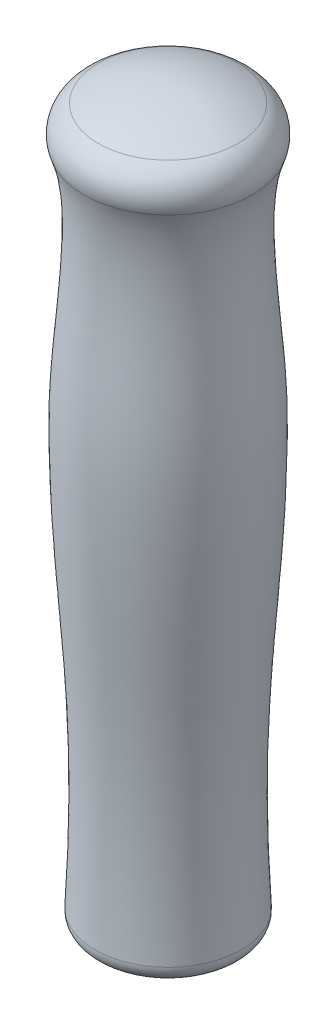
from build123d import *

# Parameters (mm, degrees)
FILLET1_R = 2.54
FILLET2_R = 4.7625


with BuildPart() as part:
    # Sketch1 → Revolve1 (revolve)
    with BuildSketch(Plane.XY):
        with BuildLine():
            Line((7.9375, 0), (11.7475, 0))
            add(Edge.make_bspline(
                [(11.7475, 0), (9.90178857, 30.057250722), (13.130992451, 43.656543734), (13.602666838, 83.018924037), (9.458950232, 103.277798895), (15.147412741, 110.596527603)],
                knots=[0, 0, 0, 0, 0.584486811, 0.665001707, 1, 1, 1, 1], degree=3))
            ThreePointArc((15.147412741, 110.596527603), (8.022445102, 114.526698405), (0, 115.8875))
            Line((0, 115.8875), (0, 113.212488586))
            ThreePointArc((0, 113.212488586), (4.039674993, 112.832323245), (7.9375, 111.705176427))
            Line((7.9375, 111.705176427), (7.9375, 0))
        make_face()
    revolve(axis=Axis((0, 0, 0), (0, 1, 0)))

    # Fillet1
    fillet1_edges = [part.edges().sort_by_distance(p)[0] for p in [
        (-11.7475, 0, 0),
    ]]
    fillet(fillet1_edges, radius=FILLET1_R)

    # Fillet2
    fillet2_edges = [part.edges().sort_by_distance(p)[0] for p in [
        (-15.147412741, 110.596527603, 0),
    ]]
    fillet(fillet2_edges, radius=FILLET2_R)


solid = part.part
